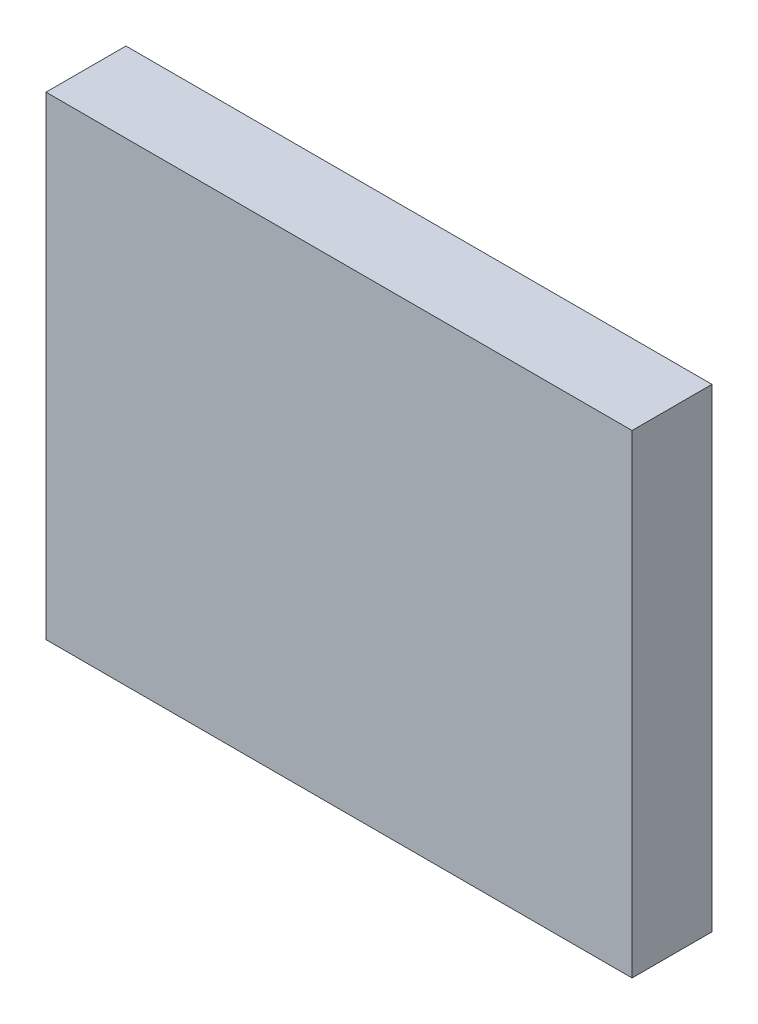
ISO-10303-21;
HEADER;
FILE_DESCRIPTION(('STEP AP214'),'2;1');
FILE_NAME('part.step','',(''),(''),'','','');
FILE_SCHEMA(('AUTOMOTIVE_DESIGN { 1 0 10303 214 1 1 1 1 }'));
ENDSEC;
DATA;
#1=APPLICATION_CONTEXT('core data for automotive mechanical design processes');
#2=APPLICATION_PROTOCOL_DEFINITION('international standard','automotive_design',2000,#1);
#3=PRODUCT_CONTEXT('',#1,'mechanical');
#4=PRODUCT('Part','Part','',(#3));
#5=PRODUCT_RELATED_PRODUCT_CATEGORY('part','',(#4));
#6=PRODUCT_DEFINITION_FORMATION('','',#4);
#7=PRODUCT_DEFINITION_CONTEXT('part definition',#1,'design');
#8=PRODUCT_DEFINITION('design','',#6,#7);
#9=PRODUCT_DEFINITION_SHAPE('','',#8);
#10=(LENGTH_UNIT() NAMED_UNIT(*) SI_UNIT(.MILLI.,.METRE.));
#11=(NAMED_UNIT(*) PLANE_ANGLE_UNIT() SI_UNIT($,.RADIAN.));
#12=(NAMED_UNIT(*) SI_UNIT($,.STERADIAN.) SOLID_ANGLE_UNIT());
#13=UNCERTAINTY_MEASURE_WITH_UNIT(LENGTH_MEASURE(1.E-05),#10,'distance_accuracy_value','');
#14=(GEOMETRIC_REPRESENTATION_CONTEXT(3) GLOBAL_UNCERTAINTY_ASSIGNED_CONTEXT((#13)) GLOBAL_UNIT_ASSIGNED_CONTEXT((#10,
#11,#12)) REPRESENTATION_CONTEXT('',''));
#15=CARTESIAN_POINT('',(0.,0.,0.));
#16=DIRECTION('',(0.,0.,1.));
#17=DIRECTION('',(1.,0.,0.));
#18=AXIS2_PLACEMENT_3D('',#15,#16,#17);
#19=CARTESIAN_POINT('',(0.,0.,15.));
#20=DIRECTION('',(-1.,0.,0.));
#21=DIRECTION('',(0.,0.,1.));
#22=AXIS2_PLACEMENT_3D('',#19,#20,#21);
#23=PLANE('',#22);
#24=DIRECTION('',(0.,1.,0.));
#25=VECTOR('',#24,1.);
#26=CARTESIAN_POINT('',(0.,0.,0.));
#27=LINE('',#26,#25);
#28=CARTESIAN_POINT('',(0.,0.,0.));
#29=VERTEX_POINT('',#28);
#30=CARTESIAN_POINT('',(0.,89.,0.));
#31=VERTEX_POINT('',#30);
#32=EDGE_CURVE('E95',#29,#31,#27,.T.);
#33=ORIENTED_EDGE('',*,*,#32,.T.);
#34=DIRECTION('',(0.,0.,-1.));
#35=VECTOR('',#34,1.);
#36=CARTESIAN_POINT('',(0.,89.,15.));
#37=LINE('',#36,#35);
#38=CARTESIAN_POINT('',(0.,89.,15.));
#39=VERTEX_POINT('',#38);
#40=EDGE_CURVE('E11',#39,#31,#37,.T.);
#41=ORIENTED_EDGE('',*,*,#40,.F.);
#42=DIRECTION('',(0.,1.,0.));
#43=VECTOR('',#42,1.);
#44=CARTESIAN_POINT('',(0.,0.,15.));
#45=LINE('',#44,#43);
#46=CARTESIAN_POINT('',(0.,0.,15.));
#47=VERTEX_POINT('',#46);
#48=EDGE_CURVE('E83',#47,#39,#45,.T.);
#49=ORIENTED_EDGE('',*,*,#48,.F.);
#50=DIRECTION('',(0.,0.,-1.));
#51=VECTOR('',#50,1.);
#52=CARTESIAN_POINT('',(0.,0.,15.));
#53=LINE('',#52,#51);
#54=EDGE_CURVE('E91',#47,#29,#53,.T.);
#55=ORIENTED_EDGE('',*,*,#54,.T.);
#56=EDGE_LOOP('',(#33,#41,#49,#55));
#57=FACE_BOUND('',#56,.T.);
#58=ADVANCED_FACE('F32',(#57),#23,.F.);
#59=CARTESIAN_POINT('',(0.,89.,15.));
#60=DIRECTION('',(0.,-1.,0.));
#61=DIRECTION('',(1.,0.,0.));
#62=AXIS2_PLACEMENT_3D('',#59,#60,#61);
#63=PLANE('',#62);
#64=DIRECTION('',(-1.,0.,0.));
#65=VECTOR('',#64,1.);
#66=CARTESIAN_POINT('',(0.,89.,0.));
#67=LINE('',#66,#65);
#68=CARTESIAN_POINT('',(-110.,89.,0.));
#69=VERTEX_POINT('',#68);
#70=EDGE_CURVE('E87',#31,#69,#67,.T.);
#71=ORIENTED_EDGE('',*,*,#70,.T.);
#72=DIRECTION('',(0.,0.,-1.));
#73=VECTOR('',#72,1.);
#74=CARTESIAN_POINT('',(-110.,89.,15.));
#75=LINE('',#74,#73);
#76=CARTESIAN_POINT('',(-110.,89.,15.));
#77=VERTEX_POINT('',#76);
#78=EDGE_CURVE('E40',#77,#69,#75,.T.);
#79=ORIENTED_EDGE('',*,*,#78,.F.);
#80=DIRECTION('',(-1.,0.,0.));
#81=VECTOR('',#80,1.);
#82=CARTESIAN_POINT('',(0.,89.,15.));
#83=LINE('',#82,#81);
#84=EDGE_CURVE('E78',#39,#77,#83,.T.);
#85=ORIENTED_EDGE('',*,*,#84,.F.);
#86=ORIENTED_EDGE('',*,*,#40,.T.);
#87=EDGE_LOOP('',(#71,#79,#85,#86));
#88=FACE_BOUND('',#87,.T.);
#89=ADVANCED_FACE('F86',(#88),#63,.F.);
#90=CARTESIAN_POINT('',(-110.,0.,15.));
#91=DIRECTION('',(1.,0.,0.));
#92=DIRECTION('',(0.,0.,-1.));
#93=AXIS2_PLACEMENT_3D('',#90,#91,#92);
#94=PLANE('',#93);
#95=DIRECTION('',(0.,-1.,0.));
#96=VECTOR('',#95,1.);
#97=CARTESIAN_POINT('',(-110.,0.,0.));
#98=LINE('',#97,#96);
#99=CARTESIAN_POINT('',(-110.,0.,0.));
#100=VERTEX_POINT('',#99);
#101=EDGE_CURVE('E65',#69,#100,#98,.T.);
#102=ORIENTED_EDGE('',*,*,#101,.T.);
#103=DIRECTION('',(0.,0.,-1.));
#104=VECTOR('',#103,1.);
#105=CARTESIAN_POINT('',(-110.,0.,15.));
#106=LINE('',#105,#104);
#107=CARTESIAN_POINT('',(-110.,0.,15.));
#108=VERTEX_POINT('',#107);
#109=EDGE_CURVE('E88',#108,#100,#106,.T.);
#110=ORIENTED_EDGE('',*,*,#109,.F.);
#111=DIRECTION('',(0.,-1.,0.));
#112=VECTOR('',#111,1.);
#113=CARTESIAN_POINT('',(-110.,0.,15.));
#114=LINE('',#113,#112);
#115=EDGE_CURVE('E81',#77,#108,#114,.T.);
#116=ORIENTED_EDGE('',*,*,#115,.F.);
#117=ORIENTED_EDGE('',*,*,#78,.T.);
#118=EDGE_LOOP('',(#102,#110,#116,#117));
#119=FACE_BOUND('',#118,.T.);
#120=ADVANCED_FACE('F89',(#119),#94,.F.);
#121=CARTESIAN_POINT('',(0.,0.,15.));
#122=DIRECTION('',(0.,1.,0.));
#123=DIRECTION('',(-1.,0.,0.));
#124=AXIS2_PLACEMENT_3D('',#121,#122,#123);
#125=PLANE('',#124);
#126=DIRECTION('',(1.,0.,0.));
#127=VECTOR('',#126,1.);
#128=CARTESIAN_POINT('',(0.,0.,0.));
#129=LINE('',#128,#127);
#130=EDGE_CURVE('E71',#100,#29,#129,.T.);
#131=ORIENTED_EDGE('',*,*,#130,.T.);
#132=ORIENTED_EDGE('',*,*,#54,.F.);
#133=DIRECTION('',(1.,0.,0.));
#134=VECTOR('',#133,1.);
#135=CARTESIAN_POINT('',(0.,0.,15.));
#136=LINE('',#135,#134);
#137=EDGE_CURVE('E48',#108,#47,#136,.T.);
#138=ORIENTED_EDGE('',*,*,#137,.F.);
#139=ORIENTED_EDGE('',*,*,#109,.T.);
#140=EDGE_LOOP('',(#131,#132,#138,#139));
#141=FACE_BOUND('',#140,.T.);
#142=ADVANCED_FACE('F102',(#141),#125,.F.);
#143=CARTESIAN_POINT('',(0.,0.,15.));
#144=DIRECTION('',(0.,0.,1.));
#145=DIRECTION('',(1.,0.,0.));
#146=AXIS2_PLACEMENT_3D('',#143,#144,#145);
#147=PLANE('',#146);
#148=ORIENTED_EDGE('',*,*,#48,.T.);
#149=ORIENTED_EDGE('',*,*,#84,.T.);
#150=ORIENTED_EDGE('',*,*,#115,.T.);
#151=ORIENTED_EDGE('',*,*,#137,.T.);
#152=EDGE_LOOP('',(#148,#149,#150,#151));
#153=FACE_BOUND('',#152,.T.);
#154=ADVANCED_FACE('F79',(#153),#147,.T.);
#155=CARTESIAN_POINT('',(0.,0.,0.));
#156=DIRECTION('',(0.,0.,1.));
#157=DIRECTION('',(1.,0.,0.));
#158=AXIS2_PLACEMENT_3D('',#155,#156,#157);
#159=PLANE('',#158);
#160=ORIENTED_EDGE('',*,*,#32,.F.);
#161=ORIENTED_EDGE('',*,*,#130,.F.);
#162=ORIENTED_EDGE('',*,*,#101,.F.);
#163=ORIENTED_EDGE('',*,*,#70,.F.);
#164=EDGE_LOOP('',(#160,#161,#162,#163));
#165=FACE_BOUND('',#164,.T.);
#166=ADVANCED_FACE('F105',(#165),#159,.F.);
#167=CLOSED_SHELL('',(#58,#89,#120,#142,#154,#166));
#168=MANIFOLD_SOLID_BREP('B2',#167);
#169=ADVANCED_BREP_SHAPE_REPRESENTATION('',(#18,#168),#14);
#170=SHAPE_DEFINITION_REPRESENTATION(#9,#169);
ENDSEC;
END-ISO-10303-21;
